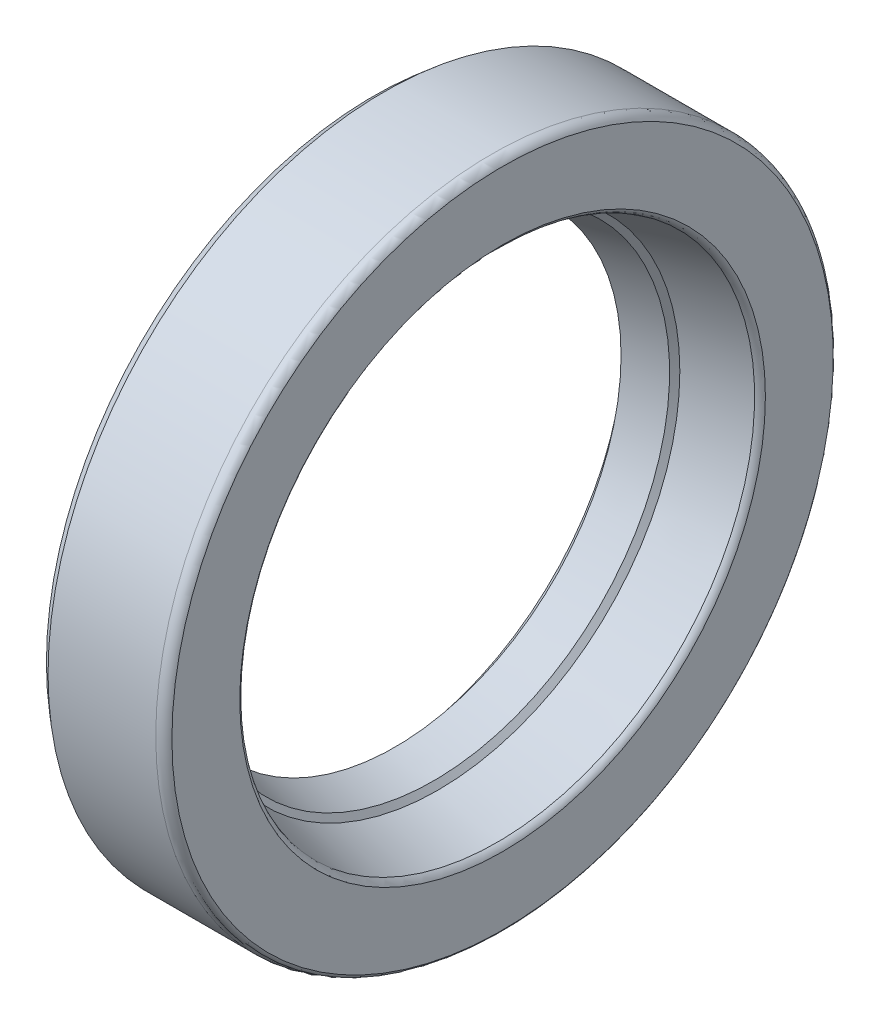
ISO-10303-21;
HEADER;
FILE_DESCRIPTION(('STEP AP214'),'2;1');
FILE_NAME('part.step','',(''),(''),'','','');
FILE_SCHEMA(('AUTOMOTIVE_DESIGN { 1 0 10303 214 1 1 1 1 }'));
ENDSEC;
DATA;
#1=APPLICATION_CONTEXT('core data for automotive mechanical design processes');
#2=APPLICATION_PROTOCOL_DEFINITION('international standard','automotive_design',2000,#1);
#3=PRODUCT_CONTEXT('',#1,'mechanical');
#4=PRODUCT('Part','Part','',(#3));
#5=PRODUCT_RELATED_PRODUCT_CATEGORY('part','',(#4));
#6=PRODUCT_DEFINITION_FORMATION('','',#4);
#7=PRODUCT_DEFINITION_CONTEXT('part definition',#1,'design');
#8=PRODUCT_DEFINITION('design','',#6,#7);
#9=PRODUCT_DEFINITION_SHAPE('','',#8);
#10=(LENGTH_UNIT() NAMED_UNIT(*) SI_UNIT(.MILLI.,.METRE.));
#11=(NAMED_UNIT(*) PLANE_ANGLE_UNIT() SI_UNIT($,.RADIAN.));
#12=(NAMED_UNIT(*) SI_UNIT($,.STERADIAN.) SOLID_ANGLE_UNIT());
#13=UNCERTAINTY_MEASURE_WITH_UNIT(LENGTH_MEASURE(1.E-05),#10,'distance_accuracy_value','');
#14=(GEOMETRIC_REPRESENTATION_CONTEXT(3) GLOBAL_UNCERTAINTY_ASSIGNED_CONTEXT((#13)) GLOBAL_UNIT_ASSIGNED_CONTEXT((#10,
#11,#12)) REPRESENTATION_CONTEXT('',''));
#15=CARTESIAN_POINT('',(0.,0.,0.));
#16=DIRECTION('',(0.,0.,1.));
#17=DIRECTION('',(1.,0.,0.));
#18=AXIS2_PLACEMENT_3D('',#15,#16,#17);
#19=CARTESIAN_POINT('',(1.66666666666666,0.,0.));
#20=DIRECTION('',(-1.,0.,0.));
#21=DIRECTION('',(0.,0.,1.));
#22=AXIS2_PLACEMENT_3D('',#19,#20,#21);
#23=CYLINDRICAL_SURFACE('',#22,26.);
#24=CARTESIAN_POINT('',(9.16666666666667,0.,0.));
#25=DIRECTION('',(-1.,0.,0.));
#26=DIRECTION('',(0.,0.,1.));
#27=AXIS2_PLACEMENT_3D('',#24,#25,#26);
#28=CIRCLE('',#27,26.);
#29=CARTESIAN_POINT('',(9.16666666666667,0.,26.));
#30=VERTEX_POINT('',#29);
#31=EDGE_CURVE('E91',#30,#30,#28,.T.);
#32=ORIENTED_EDGE('',*,*,#31,.T.);
#33=EDGE_LOOP('',(#32));
#34=FACE_BOUND('',#33,.T.);
#35=CARTESIAN_POINT('',(0.833333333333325,0.,0.));
#36=DIRECTION('',(-1.,0.,0.));
#37=DIRECTION('',(0.,0.,1.));
#38=AXIS2_PLACEMENT_3D('',#35,#36,#37);
#39=CIRCLE('',#38,26.);
#40=CARTESIAN_POINT('',(0.833333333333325,0.,26.));
#41=VERTEX_POINT('',#40);
#42=EDGE_CURVE('E10',#41,#41,#39,.T.);
#43=ORIENTED_EDGE('',*,*,#42,.F.);
#44=EDGE_LOOP('',(#43));
#45=FACE_BOUND('',#44,.T.);
#46=ADVANCED_FACE('F14',(#34,#45),#23,.T.);
#47=CARTESIAN_POINT('',(0.,0.,0.));
#48=DIRECTION('',(1.,0.,0.));
#49=DIRECTION('',(0.,0.,-1.));
#50=AXIS2_PLACEMENT_3D('',#47,#48,#49);
#51=CONICAL_SURFACE('',#50,25.2916666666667,0.704494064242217);
#52=ORIENTED_EDGE('',*,*,#42,.T.);
#53=EDGE_LOOP('',(#52));
#54=FACE_BOUND('',#53,.T.);
#55=CARTESIAN_POINT('',(0.,0.,0.));
#56=DIRECTION('',(-1.,0.,0.));
#57=DIRECTION('',(0.,0.,1.));
#58=AXIS2_PLACEMENT_3D('',#55,#56,#57);
#59=CIRCLE('',#58,25.2916666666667);
#60=CARTESIAN_POINT('',(0.,0.,25.2916666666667));
#61=VERTEX_POINT('',#60);
#62=EDGE_CURVE('E21',#61,#61,#59,.T.);
#63=ORIENTED_EDGE('',*,*,#62,.F.);
#64=EDGE_LOOP('',(#63));
#65=FACE_BOUND('',#64,.T.);
#66=ADVANCED_FACE('F117',(#54,#65),#51,.T.);
#67=CARTESIAN_POINT('',(0.,24.3,0.));
#68=DIRECTION('',(-1.,0.,0.));
#69=DIRECTION('',(0.,0.,1.));
#70=AXIS2_PLACEMENT_3D('',#67,#68,#69);
#71=PLANE('',#70);
#72=ORIENTED_EDGE('',*,*,#62,.T.);
#73=EDGE_LOOP('',(#72));
#74=FACE_BOUND('',#73,.T.);
#75=CARTESIAN_POINT('',(0.,0.,0.));
#76=DIRECTION('',(-1.,0.,0.));
#77=DIRECTION('',(0.,0.,1.));
#78=AXIS2_PLACEMENT_3D('',#75,#76,#77);
#79=CIRCLE('',#78,24.3);
#80=CARTESIAN_POINT('',(0.,0.,24.3));
#81=VERTEX_POINT('',#80);
#82=EDGE_CURVE('E30',#81,#81,#79,.T.);
#83=ORIENTED_EDGE('',*,*,#82,.F.);
#84=EDGE_LOOP('',(#83));
#85=FACE_BOUND('',#84,.T.);
#86=ADVANCED_FACE('F120',(#74,#85),#71,.T.);
#87=CARTESIAN_POINT('',(0.,0.,0.));
#88=DIRECTION('',(-1.,0.,0.));
#89=DIRECTION('',(0.,0.,1.));
#90=AXIS2_PLACEMENT_3D('',#87,#88,#89);
#91=CONICAL_SURFACE('',#90,24.3,0.0759728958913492);
#92=CARTESIAN_POINT('',(5.58333333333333,0.,0.));
#93=DIRECTION('',(-1.,0.,0.));
#94=DIRECTION('',(0.,0.,1.));
#95=AXIS2_PLACEMENT_3D('',#92,#93,#94);
#96=CIRCLE('',#95,23.875);
#97=CARTESIAN_POINT('',(5.58333333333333,0.,23.875));
#98=VERTEX_POINT('',#97);
#99=EDGE_CURVE('E37',#98,#98,#96,.T.);
#100=ORIENTED_EDGE('',*,*,#99,.F.);
#101=EDGE_LOOP('',(#100));
#102=FACE_BOUND('',#101,.T.);
#103=ORIENTED_EDGE('',*,*,#82,.T.);
#104=EDGE_LOOP('',(#103));
#105=FACE_BOUND('',#104,.T.);
#106=ADVANCED_FACE('F123',(#102,#105),#91,.F.);
#107=CARTESIAN_POINT('',(5.24046847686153,0.,0.));
#108=DIRECTION('',(-1.,0.,0.));
#109=DIRECTION('',(0.,0.,1.));
#110=AXIS2_PLACEMENT_3D('',#107,#108,#109);
#111=TOROIDAL_SURFACE('',#110,23.1154684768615,0.833333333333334);
#112=ORIENTED_EDGE('',*,*,#99,.T.);
#113=EDGE_LOOP('',(#112));
#114=FACE_BOUND('',#113,.T.);
#115=CARTESIAN_POINT('',(5.99999999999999,0.,0.));
#116=DIRECTION('',(-1.,0.,0.));
#117=DIRECTION('',(0.,0.,1.));
#118=AXIS2_PLACEMENT_3D('',#115,#116,#117);
#119=CIRCLE('',#118,23.4583333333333);
#120=CARTESIAN_POINT('',(5.99999999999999,0.,23.4583333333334));
#121=VERTEX_POINT('',#120);
#122=EDGE_CURVE('E43',#121,#121,#119,.T.);
#123=ORIENTED_EDGE('',*,*,#122,.F.);
#124=EDGE_LOOP('',(#123));
#125=FACE_BOUND('',#124,.T.);
#126=ADVANCED_FACE('F129',(#114,#125),#111,.F.);
#127=CARTESIAN_POINT('',(5.99999999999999,23.4583333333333,0.));
#128=DIRECTION('',(1.,0.,0.));
#129=DIRECTION('',(0.,0.,-1.));
#130=AXIS2_PLACEMENT_3D('',#127,#128,#129);
#131=PLANE('',#130);
#132=CARTESIAN_POINT('',(5.99999999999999,0.,0.));
#133=DIRECTION('',(-1.,0.,0.));
#134=DIRECTION('',(0.,0.,1.));
#135=AXIS2_PLACEMENT_3D('',#132,#133,#134);
#136=CIRCLE('',#135,20.3333333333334);
#137=CARTESIAN_POINT('',(5.99999999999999,0.,20.3333333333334));
#138=VERTEX_POINT('',#137);
#139=EDGE_CURVE('E47',#138,#138,#136,.T.);
#140=ORIENTED_EDGE('',*,*,#139,.F.);
#141=EDGE_LOOP('',(#140));
#142=FACE_BOUND('',#141,.T.);
#143=ORIENTED_EDGE('',*,*,#122,.T.);
#144=EDGE_LOOP('',(#143));
#145=FACE_BOUND('',#144,.T.);
#146=ADVANCED_FACE('F133',(#142,#145),#131,.F.);
#147=CARTESIAN_POINT('',(5.99999999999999,0.,0.));
#148=DIRECTION('',(1.,0.,0.));
#149=DIRECTION('',(0.,0.,-1.));
#150=AXIS2_PLACEMENT_3D('',#147,#148,#149);
#151=CONICAL_SURFACE('',#150,20.3333333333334,0.199683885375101);
#152=CARTESIAN_POINT('',(3.62954324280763,0.,0.));
#153=DIRECTION('',(-1.,0.,0.));
#154=DIRECTION('',(0.,0.,1.));
#155=AXIS2_PLACEMENT_3D('',#152,#153,#154);
#156=CIRCLE('',#155,19.8535980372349);
#157=CARTESIAN_POINT('',(3.62954324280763,0.,19.8535980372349));
#158=VERTEX_POINT('',#157);
#159=EDGE_CURVE('E51',#158,#158,#156,.T.);
#160=ORIENTED_EDGE('',*,*,#159,.F.);
#161=EDGE_LOOP('',(#160));
#162=FACE_BOUND('',#161,.T.);
#163=ORIENTED_EDGE('',*,*,#139,.T.);
#164=EDGE_LOOP('',(#163));
#165=FACE_BOUND('',#164,.T.);
#166=ADVANCED_FACE('F137',(#162,#165),#151,.T.);
#167=CARTESIAN_POINT('',(2.5,0.,0.));
#168=DIRECTION('',(-1.,0.,0.));
#169=DIRECTION('',(0.,0.,1.));
#170=AXIS2_PLACEMENT_3D('',#167,#168,#169);
#171=TOROIDAL_SURFACE('',#170,19.625,1.15244305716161);
#172=CARTESIAN_POINT('',(1.99766171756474,0.,0.));
#173=DIRECTION('',(-1.,0.,0.));
#174=DIRECTION('',(0.,0.,1.));
#175=AXIS2_PLACEMENT_3D('',#172,#173,#174);
#176=CIRCLE('',#175,20.6621987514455);
#177=CARTESIAN_POINT('',(1.99766171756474,0.,20.6621987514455));
#178=VERTEX_POINT('',#177);
#179=EDGE_CURVE('E55',#178,#178,#176,.T.);
#180=ORIENTED_EDGE('',*,*,#179,.F.);
#181=EDGE_LOOP('',(#180));
#182=FACE_BOUND('',#181,.T.);
#183=ORIENTED_EDGE('',*,*,#159,.T.);
#184=EDGE_LOOP('',(#183));
#185=FACE_BOUND('',#184,.T.);
#186=ADVANCED_FACE('F141',(#182,#185),#171,.T.);
#187=CARTESIAN_POINT('',(1.66666666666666,0.,0.));
#188=DIRECTION('',(-1.,0.,0.));
#189=DIRECTION('',(0.,0.,1.));
#190=AXIS2_PLACEMENT_3D('',#187,#188,#189);
#191=CYLINDRICAL_SURFACE('',#190,20.6621987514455);
#192=ORIENTED_EDGE('',*,*,#179,.T.);
#193=EDGE_LOOP('',(#192));
#194=FACE_BOUND('',#193,.T.);
#195=CARTESIAN_POINT('',(0.666666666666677,0.,0.));
#196=DIRECTION('',(-1.,0.,0.));
#197=DIRECTION('',(0.,0.,1.));
#198=AXIS2_PLACEMENT_3D('',#195,#196,#197);
#199=CIRCLE('',#198,20.6621987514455);
#200=CARTESIAN_POINT('',(0.666666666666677,0.,20.6621987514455));
#201=VERTEX_POINT('',#200);
#202=EDGE_CURVE('E59',#201,#201,#199,.T.);
#203=ORIENTED_EDGE('',*,*,#202,.F.);
#204=EDGE_LOOP('',(#203));
#205=FACE_BOUND('',#204,.T.);
#206=ADVANCED_FACE('F145',(#194,#205),#191,.T.);
#207=CARTESIAN_POINT('',(0.666666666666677,18.7142857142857,0.));
#208=DIRECTION('',(-1.,0.,0.));
#209=DIRECTION('',(0.,0.,1.));
#210=AXIS2_PLACEMENT_3D('',#207,#208,#209);
#211=PLANE('',#210);
#212=ORIENTED_EDGE('',*,*,#202,.T.);
#213=EDGE_LOOP('',(#212));
#214=FACE_BOUND('',#213,.T.);
#215=CARTESIAN_POINT('',(0.666666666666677,0.,0.));
#216=DIRECTION('',(-1.,0.,0.));
#217=DIRECTION('',(0.,0.,1.));
#218=AXIS2_PLACEMENT_3D('',#215,#216,#217);
#219=CIRCLE('',#218,18.7142857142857);
#220=CARTESIAN_POINT('',(0.666666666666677,0.,18.7142857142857));
#221=VERTEX_POINT('',#220);
#222=EDGE_CURVE('E63',#221,#221,#219,.T.);
#223=ORIENTED_EDGE('',*,*,#222,.F.);
#224=EDGE_LOOP('',(#223));
#225=FACE_BOUND('',#224,.T.);
#226=ADVANCED_FACE('F149',(#214,#225),#211,.T.);
#227=CARTESIAN_POINT('',(1.66666666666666,0.,0.));
#228=DIRECTION('',(-1.,0.,0.));
#229=DIRECTION('',(0.,0.,1.));
#230=AXIS2_PLACEMENT_3D('',#227,#228,#229);
#231=CONICAL_SURFACE('',#230,17.5,0.881871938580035);
#232=ORIENTED_EDGE('',*,*,#222,.T.);
#233=EDGE_LOOP('',(#232));
#234=FACE_BOUND('',#233,.T.);
#235=CARTESIAN_POINT('',(1.66666666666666,0.,0.));
#236=DIRECTION('',(-1.,0.,0.));
#237=DIRECTION('',(0.,0.,1.));
#238=AXIS2_PLACEMENT_3D('',#235,#236,#237);
#239=CIRCLE('',#238,17.5);
#240=CARTESIAN_POINT('',(1.66666666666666,0.,17.5));
#241=VERTEX_POINT('',#240);
#242=EDGE_CURVE('E67',#241,#241,#239,.T.);
#243=ORIENTED_EDGE('',*,*,#242,.F.);
#244=EDGE_LOOP('',(#243));
#245=FACE_BOUND('',#244,.T.);
#246=ADVANCED_FACE('F153',(#234,#245),#231,.F.);
#247=CARTESIAN_POINT('',(4.66666666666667,0.,0.));
#248=DIRECTION('',(1.,0.,0.));
#249=DIRECTION('',(0.,0.,-1.));
#250=AXIS2_PLACEMENT_3D('',#247,#248,#249);
#251=CONICAL_SURFACE('',#250,18.2555555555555,0.246720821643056);
#252=ORIENTED_EDGE('',*,*,#242,.T.);
#253=EDGE_LOOP('',(#252));
#254=FACE_BOUND('',#253,.T.);
#255=CARTESIAN_POINT('',(4.66666666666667,0.,0.));
#256=DIRECTION('',(-1.,0.,0.));
#257=DIRECTION('',(0.,0.,1.));
#258=AXIS2_PLACEMENT_3D('',#255,#256,#257);
#259=CIRCLE('',#258,18.2555555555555);
#260=CARTESIAN_POINT('',(4.66666666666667,0.,18.2555555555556));
#261=VERTEX_POINT('',#260);
#262=EDGE_CURVE('E71',#261,#261,#259,.T.);
#263=ORIENTED_EDGE('',*,*,#262,.F.);
#264=EDGE_LOOP('',(#263));
#265=FACE_BOUND('',#264,.T.);
#266=ADVANCED_FACE('F157',(#254,#265),#251,.F.);
#267=CARTESIAN_POINT('',(4.99999999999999,0.,0.));
#268=DIRECTION('',(1.,0.,0.));
#269=DIRECTION('',(0.,0.,-1.));
#270=AXIS2_PLACEMENT_3D('',#267,#268,#269);
#271=CONICAL_SURFACE('',#270,18.7142857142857,0.94241164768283);
#272=ORIENTED_EDGE('',*,*,#262,.T.);
#273=EDGE_LOOP('',(#272));
#274=FACE_BOUND('',#273,.T.);
#275=CARTESIAN_POINT('',(4.99999999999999,0.,0.));
#276=DIRECTION('',(-1.,0.,0.));
#277=DIRECTION('',(0.,0.,1.));
#278=AXIS2_PLACEMENT_3D('',#275,#276,#277);
#279=CIRCLE('',#278,18.7142857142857);
#280=CARTESIAN_POINT('',(4.99999999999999,0.,18.7142857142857));
#281=VERTEX_POINT('',#280);
#282=EDGE_CURVE('E75',#281,#281,#279,.T.);
#283=ORIENTED_EDGE('',*,*,#282,.F.);
#284=EDGE_LOOP('',(#283));
#285=FACE_BOUND('',#284,.T.);
#286=ADVANCED_FACE('F161',(#274,#285),#271,.F.);
#287=CARTESIAN_POINT('',(9.58333333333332,0.,0.));
#288=DIRECTION('',(1.,0.,0.));
#289=DIRECTION('',(0.,0.,-1.));
#290=AXIS2_PLACEMENT_3D('',#287,#288,#289);
#291=CONICAL_SURFACE('',#290,19.9166666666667,0.256556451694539);
#292=ORIENTED_EDGE('',*,*,#282,.T.);
#293=EDGE_LOOP('',(#292));
#294=FACE_BOUND('',#293,.T.);
#295=CARTESIAN_POINT('',(9.58333333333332,0.,0.));
#296=DIRECTION('',(-1.,0.,0.));
#297=DIRECTION('',(0.,0.,1.));
#298=AXIS2_PLACEMENT_3D('',#295,#296,#297);
#299=CIRCLE('',#298,19.9166666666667);
#300=CARTESIAN_POINT('',(9.58333333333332,0.,19.9166666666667));
#301=VERTEX_POINT('',#300);
#302=EDGE_CURVE('E79',#301,#301,#299,.T.);
#303=ORIENTED_EDGE('',*,*,#302,.F.);
#304=EDGE_LOOP('',(#303));
#305=FACE_BOUND('',#304,.T.);
#306=ADVANCED_FACE('F113',(#294,#305),#291,.F.);
#307=CARTESIAN_POINT('',(9.24046847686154,0.,0.));
#308=DIRECTION('',(-1.,0.,0.));
#309=DIRECTION('',(0.,0.,1.));
#310=AXIS2_PLACEMENT_3D('',#307,#308,#309);
#311=TOROIDAL_SURFACE('',#310,20.6761981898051,0.833333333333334);
#312=CARTESIAN_POINT('',(9.99999999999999,0.,0.));
#313=DIRECTION('',(-1.,0.,0.));
#314=DIRECTION('',(0.,0.,1.));
#315=AXIS2_PLACEMENT_3D('',#312,#313,#314);
#316=CIRCLE('',#315,20.3333333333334);
#317=CARTESIAN_POINT('',(9.99999999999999,0.,20.3333333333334));
#318=VERTEX_POINT('',#317);
#319=EDGE_CURVE('E83',#318,#318,#316,.T.);
#320=ORIENTED_EDGE('',*,*,#319,.F.);
#321=EDGE_LOOP('',(#320));
#322=FACE_BOUND('',#321,.T.);
#323=ORIENTED_EDGE('',*,*,#302,.T.);
#324=EDGE_LOOP('',(#323));
#325=FACE_BOUND('',#324,.T.);
#326=ADVANCED_FACE('F107',(#322,#325),#311,.T.);
#327=CARTESIAN_POINT('',(9.99999999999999,25.5833333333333,0.));
#328=DIRECTION('',(1.,0.,0.));
#329=DIRECTION('',(0.,0.,-1.));
#330=AXIS2_PLACEMENT_3D('',#327,#328,#329);
#331=PLANE('',#330);
#332=ORIENTED_EDGE('',*,*,#319,.T.);
#333=EDGE_LOOP('',(#332));
#334=FACE_BOUND('',#333,.T.);
#335=CARTESIAN_POINT('',(9.99999999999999,0.,0.));
#336=DIRECTION('',(-1.,0.,0.));
#337=DIRECTION('',(0.,0.,1.));
#338=AXIS2_PLACEMENT_3D('',#335,#336,#337);
#339=CIRCLE('',#338,25.5833333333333);
#340=CARTESIAN_POINT('',(9.99999999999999,0.,25.5833333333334));
#341=VERTEX_POINT('',#340);
#342=EDGE_CURVE('E87',#341,#341,#339,.T.);
#343=ORIENTED_EDGE('',*,*,#342,.F.);
#344=EDGE_LOOP('',(#343));
#345=FACE_BOUND('',#344,.T.);
#346=ADVANCED_FACE('F102',(#334,#345),#331,.T.);
#347=CARTESIAN_POINT('',(9.27432506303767,0.,0.));
#348=DIRECTION('',(-1.,0.,0.));
#349=DIRECTION('',(0.,0.,1.));
#350=AXIS2_PLACEMENT_3D('',#347,#348,#349);
#351=TOROIDAL_SURFACE('',#350,25.1736501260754,0.833333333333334);
#352=ORIENTED_EDGE('',*,*,#31,.F.);
#353=EDGE_LOOP('',(#352));
#354=FACE_BOUND('',#353,.T.);
#355=ORIENTED_EDGE('',*,*,#342,.T.);
#356=EDGE_LOOP('',(#355));
#357=FACE_BOUND('',#356,.T.);
#358=ADVANCED_FACE('F99',(#354,#357),#351,.T.);
#359=CLOSED_SHELL('',(#46,#66,#86,#106,#126,#146,#166,#186,#206,#226,#246,#266,#286,#306,#326,
#346,#358));
#360=MANIFOLD_SOLID_BREP('B1',#359);
#361=ADVANCED_BREP_SHAPE_REPRESENTATION('',(#18,#360),#14);
#362=SHAPE_DEFINITION_REPRESENTATION(#9,#361);
ENDSEC;
END-ISO-10303-21;
